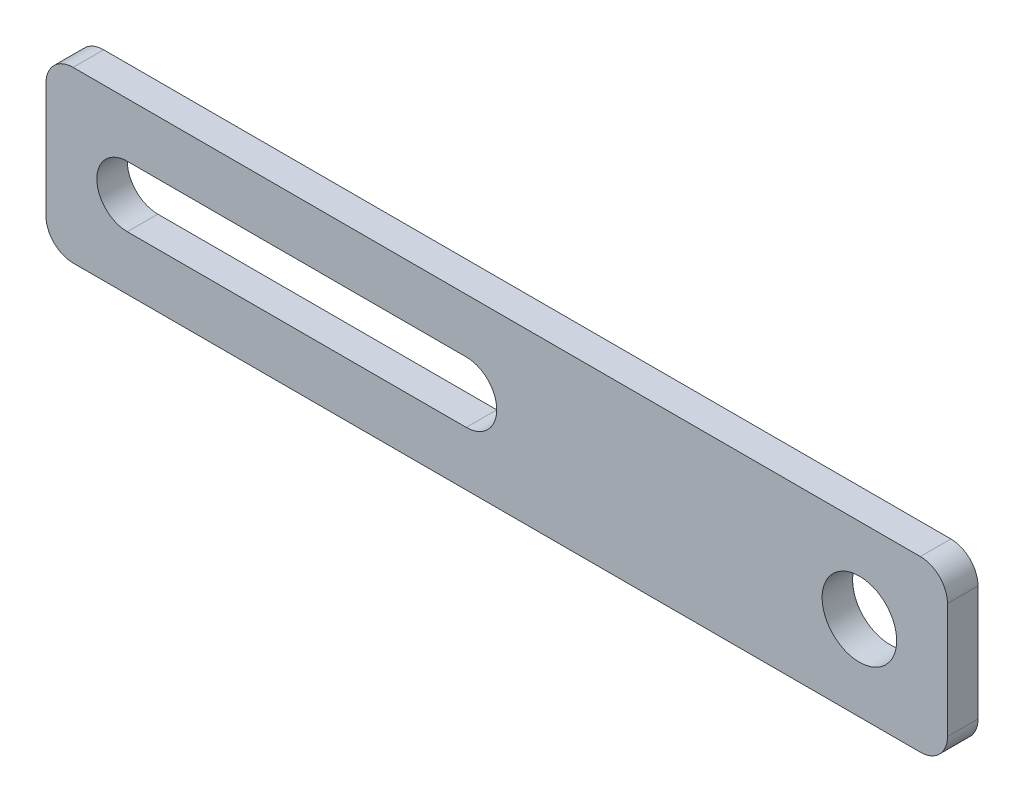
ISO-10303-21;
HEADER;
FILE_DESCRIPTION(('STEP AP214'),'2;1');
FILE_NAME('part.step','',(''),(''),'','','');
FILE_SCHEMA(('AUTOMOTIVE_DESIGN { 1 0 10303 214 1 1 1 1 }'));
ENDSEC;
DATA;
#1=APPLICATION_CONTEXT('core data for automotive mechanical design processes');
#2=APPLICATION_PROTOCOL_DEFINITION('international standard','automotive_design',2000,#1);
#3=PRODUCT_CONTEXT('',#1,'mechanical');
#4=PRODUCT('Part','Part','',(#3));
#5=PRODUCT_RELATED_PRODUCT_CATEGORY('part','',(#4));
#6=PRODUCT_DEFINITION_FORMATION('','',#4);
#7=PRODUCT_DEFINITION_CONTEXT('part definition',#1,'design');
#8=PRODUCT_DEFINITION('design','',#6,#7);
#9=PRODUCT_DEFINITION_SHAPE('','',#8);
#10=(LENGTH_UNIT() NAMED_UNIT(*) SI_UNIT(.MILLI.,.METRE.));
#11=(NAMED_UNIT(*) PLANE_ANGLE_UNIT() SI_UNIT($,.RADIAN.));
#12=(NAMED_UNIT(*) SI_UNIT($,.STERADIAN.) SOLID_ANGLE_UNIT());
#13=UNCERTAINTY_MEASURE_WITH_UNIT(LENGTH_MEASURE(1.E-05),#10,'distance_accuracy_value','');
#14=(GEOMETRIC_REPRESENTATION_CONTEXT(3) GLOBAL_UNCERTAINTY_ASSIGNED_CONTEXT((#13)) GLOBAL_UNIT_ASSIGNED_CONTEXT((#10,
#11,#12)) REPRESENTATION_CONTEXT('',''));
#15=CARTESIAN_POINT('',(0.,0.,0.));
#16=DIRECTION('',(0.,0.,1.));
#17=DIRECTION('',(1.,0.,0.));
#18=AXIS2_PLACEMENT_3D('',#15,#16,#17);
#19=CARTESIAN_POINT('',(71.,12.5,0.));
#20=DIRECTION('',(0.,0.,1.));
#21=DIRECTION('',(0.,1.,0.));
#22=AXIS2_PLACEMENT_3D('',#19,#20,#21);
#23=PLANE('',#22);
#24=DIRECTION('',(-1.,0.,0.));
#25=VECTOR('',#24,1.);
#26=CARTESIAN_POINT('',(71.,12.5,0.));
#27=LINE('',#26,#25);
#28=CARTESIAN_POINT('',(67.,12.5,0.));
#29=VERTEX_POINT('',#28);
#30=CARTESIAN_POINT('',(-58.,12.5,0.));
#31=VERTEX_POINT('',#30);
#32=EDGE_CURVE('E157',#29,#31,#27,.T.);
#33=ORIENTED_EDGE('',*,*,#32,.F.);
#34=CARTESIAN_POINT('',(67.,8.5,0.));
#35=DIRECTION('',(0.,0.,1.));
#36=DIRECTION('',(0.,1.,0.));
#37=AXIS2_PLACEMENT_3D('',#34,#35,#36);
#38=CIRCLE('',#37,4.);
#39=CARTESIAN_POINT('',(71.,8.5,0.));
#40=VERTEX_POINT('',#39);
#41=EDGE_CURVE('E194',#29,#40,#38,.F.);
#42=ORIENTED_EDGE('',*,*,#41,.T.);
#43=DIRECTION('',(0.,-1.,0.));
#44=VECTOR('',#43,1.);
#45=CARTESIAN_POINT('',(71.,12.5,0.));
#46=LINE('',#45,#44);
#47=CARTESIAN_POINT('',(71.,-8.5,0.));
#48=VERTEX_POINT('',#47);
#49=EDGE_CURVE('E169',#40,#48,#46,.T.);
#50=ORIENTED_EDGE('',*,*,#49,.T.);
#51=CARTESIAN_POINT('',(67.,-8.5,0.));
#52=DIRECTION('',(0.,0.,1.));
#53=DIRECTION('',(0.,1.,0.));
#54=AXIS2_PLACEMENT_3D('',#51,#52,#53);
#55=CIRCLE('',#54,4.);
#56=CARTESIAN_POINT('',(67.,-12.5,0.));
#57=VERTEX_POINT('',#56);
#58=EDGE_CURVE('E33',#48,#57,#55,.F.);
#59=ORIENTED_EDGE('',*,*,#58,.T.);
#60=DIRECTION('',(-1.,0.,0.));
#61=VECTOR('',#60,1.);
#62=CARTESIAN_POINT('',(71.,-12.5,0.));
#63=LINE('',#62,#61);
#64=CARTESIAN_POINT('',(-58.,-12.5,0.));
#65=VERTEX_POINT('',#64);
#66=EDGE_CURVE('E152',#57,#65,#63,.T.);
#67=ORIENTED_EDGE('',*,*,#66,.T.);
#68=CARTESIAN_POINT('',(-58.,-8.5,0.));
#69=DIRECTION('',(0.,0.,1.));
#70=DIRECTION('',(0.,1.,0.));
#71=AXIS2_PLACEMENT_3D('',#68,#69,#70);
#72=CIRCLE('',#71,4.);
#73=CARTESIAN_POINT('',(-62.,-8.5,0.));
#74=VERTEX_POINT('',#73);
#75=EDGE_CURVE('E190',#65,#74,#72,.F.);
#76=ORIENTED_EDGE('',*,*,#75,.T.);
#77=DIRECTION('',(0.,-1.,0.));
#78=VECTOR('',#77,1.);
#79=CARTESIAN_POINT('',(-62.,12.5,0.));
#80=LINE('',#79,#78);
#81=CARTESIAN_POINT('',(-62.,8.5,0.));
#82=VERTEX_POINT('',#81);
#83=EDGE_CURVE('E166',#82,#74,#80,.T.);
#84=ORIENTED_EDGE('',*,*,#83,.F.);
#85=CARTESIAN_POINT('',(-58.,8.5,0.));
#86=DIRECTION('',(0.,0.,1.));
#87=DIRECTION('',(0.,1.,0.));
#88=AXIS2_PLACEMENT_3D('',#85,#86,#87);
#89=CIRCLE('',#88,4.);
#90=EDGE_CURVE('E192',#82,#31,#89,.F.);
#91=ORIENTED_EDGE('',*,*,#90,.T.);
#92=EDGE_LOOP('',(#33,#42,#50,#59,#67,#76,#84,#91));
#93=FACE_BOUND('',#92,.T.);
#94=CARTESIAN_POINT('',(58.,0.,0.));
#95=DIRECTION('',(0.,0.,1.));
#96=DIRECTION('',(0.,1.,0.));
#97=AXIS2_PLACEMENT_3D('',#94,#95,#96);
#98=CIRCLE('',#97,5.5);
#99=CARTESIAN_POINT('',(58.,5.5,0.));
#100=VERTEX_POINT('',#99);
#101=EDGE_CURVE('E147',#100,#100,#98,.T.);
#102=ORIENTED_EDGE('',*,*,#101,.T.);
#103=EDGE_LOOP('',(#102));
#104=FACE_BOUND('',#103,.T.);
#105=CARTESIAN_POINT('',(-50.,0.,0.));
#106=DIRECTION('',(0.,0.,-1.));
#107=DIRECTION('',(0.,-1.,0.));
#108=AXIS2_PLACEMENT_3D('',#105,#106,#107);
#109=CIRCLE('',#108,4.5);
#110=CARTESIAN_POINT('',(-50.,-4.5,0.));
#111=VERTEX_POINT('',#110);
#112=CARTESIAN_POINT('',(-50.,4.5,0.));
#113=VERTEX_POINT('',#112);
#114=EDGE_CURVE('E108',#111,#113,#109,.T.);
#115=ORIENTED_EDGE('',*,*,#114,.F.);
#116=DIRECTION('',(1.,0.,0.));
#117=VECTOR('',#116,1.);
#118=CARTESIAN_POINT('',(-50.,-4.5,0.));
#119=LINE('',#118,#117);
#120=CARTESIAN_POINT('',(0.,-4.5,0.));
#121=VERTEX_POINT('',#120);
#122=EDGE_CURVE('E137',#111,#121,#119,.T.);
#123=ORIENTED_EDGE('',*,*,#122,.T.);
#124=CARTESIAN_POINT('',(0.,0.,0.));
#125=DIRECTION('',(0.,0.,1.));
#126=DIRECTION('',(0.,1.,0.));
#127=AXIS2_PLACEMENT_3D('',#124,#125,#126);
#128=CIRCLE('',#127,4.5);
#129=CARTESIAN_POINT('',(0.,4.5,0.));
#130=VERTEX_POINT('',#129);
#131=EDGE_CURVE('E134',#121,#130,#128,.T.);
#132=ORIENTED_EDGE('',*,*,#131,.T.);
#133=DIRECTION('',(1.,0.,0.));
#134=VECTOR('',#133,1.);
#135=CARTESIAN_POINT('',(-50.,4.5,0.));
#136=LINE('',#135,#134);
#137=EDGE_CURVE('E132',#113,#130,#136,.T.);
#138=ORIENTED_EDGE('',*,*,#137,.F.);
#139=EDGE_LOOP('',(#115,#123,#132,#138));
#140=FACE_BOUND('',#139,.T.);
#141=ADVANCED_FACE('F14',(#93,#104,#140),#23,.F.);
#142=CARTESIAN_POINT('',(71.,12.5,4.5));
#143=DIRECTION('',(0.,0.,1.));
#144=DIRECTION('',(0.,1.,0.));
#145=AXIS2_PLACEMENT_3D('',#142,#143,#144);
#146=PLANE('',#145);
#147=DIRECTION('',(0.,-1.,0.));
#148=VECTOR('',#147,1.);
#149=CARTESIAN_POINT('',(71.,12.5,4.5));
#150=LINE('',#149,#148);
#151=CARTESIAN_POINT('',(71.,8.5,4.5));
#152=VERTEX_POINT('',#151);
#153=CARTESIAN_POINT('',(71.,-8.5,4.5));
#154=VERTEX_POINT('',#153);
#155=EDGE_CURVE('E160',#152,#154,#150,.T.);
#156=ORIENTED_EDGE('',*,*,#155,.F.);
#157=CARTESIAN_POINT('',(67.,8.5,4.5));
#158=DIRECTION('',(0.,0.,1.));
#159=DIRECTION('',(0.,1.,0.));
#160=AXIS2_PLACEMENT_3D('',#157,#158,#159);
#161=CIRCLE('',#160,4.);
#162=CARTESIAN_POINT('',(67.,12.5,4.5));
#163=VERTEX_POINT('',#162);
#164=EDGE_CURVE('E182',#152,#163,#161,.T.);
#165=ORIENTED_EDGE('',*,*,#164,.T.);
#166=DIRECTION('',(-1.,0.,0.));
#167=VECTOR('',#166,1.);
#168=CARTESIAN_POINT('',(71.,12.5,4.5));
#169=LINE('',#168,#167);
#170=CARTESIAN_POINT('',(-58.,12.5,4.5));
#171=VERTEX_POINT('',#170);
#172=EDGE_CURVE('E154',#163,#171,#169,.T.);
#173=ORIENTED_EDGE('',*,*,#172,.T.);
#174=CARTESIAN_POINT('',(-58.,8.5,4.5));
#175=DIRECTION('',(0.,0.,1.));
#176=DIRECTION('',(0.,1.,0.));
#177=AXIS2_PLACEMENT_3D('',#174,#175,#176);
#178=CIRCLE('',#177,4.);
#179=CARTESIAN_POINT('',(-62.,8.5,4.5));
#180=VERTEX_POINT('',#179);
#181=EDGE_CURVE('E180',#171,#180,#178,.T.);
#182=ORIENTED_EDGE('',*,*,#181,.T.);
#183=DIRECTION('',(0.,-1.,0.));
#184=VECTOR('',#183,1.);
#185=CARTESIAN_POINT('',(-62.,12.5,4.5));
#186=LINE('',#185,#184);
#187=CARTESIAN_POINT('',(-62.,-8.5,4.5));
#188=VERTEX_POINT('',#187);
#189=EDGE_CURVE('E163',#180,#188,#186,.T.);
#190=ORIENTED_EDGE('',*,*,#189,.T.);
#191=CARTESIAN_POINT('',(-58.,-8.5,4.5));
#192=DIRECTION('',(0.,0.,1.));
#193=DIRECTION('',(0.,1.,0.));
#194=AXIS2_PLACEMENT_3D('',#191,#192,#193);
#195=CIRCLE('',#194,4.);
#196=CARTESIAN_POINT('',(-58.,-12.5,4.5));
#197=VERTEX_POINT('',#196);
#198=EDGE_CURVE('E178',#188,#197,#195,.T.);
#199=ORIENTED_EDGE('',*,*,#198,.T.);
#200=DIRECTION('',(-1.,0.,0.));
#201=VECTOR('',#200,1.);
#202=CARTESIAN_POINT('',(71.,-12.5,4.5));
#203=LINE('',#202,#201);
#204=CARTESIAN_POINT('',(67.,-12.5,4.5));
#205=VERTEX_POINT('',#204);
#206=EDGE_CURVE('E150',#205,#197,#203,.T.);
#207=ORIENTED_EDGE('',*,*,#206,.F.);
#208=CARTESIAN_POINT('',(67.,-8.5,4.5));
#209=DIRECTION('',(0.,0.,1.));
#210=DIRECTION('',(0.,1.,0.));
#211=AXIS2_PLACEMENT_3D('',#208,#209,#210);
#212=CIRCLE('',#211,4.);
#213=EDGE_CURVE('E176',#205,#154,#212,.T.);
#214=ORIENTED_EDGE('',*,*,#213,.T.);
#215=EDGE_LOOP('',(#156,#165,#173,#182,#190,#199,#207,#214));
#216=FACE_BOUND('',#215,.T.);
#217=CARTESIAN_POINT('',(58.,0.,4.5));
#218=DIRECTION('',(0.,0.,1.));
#219=DIRECTION('',(0.,1.,0.));
#220=AXIS2_PLACEMENT_3D('',#217,#218,#219);
#221=CIRCLE('',#220,5.5);
#222=CARTESIAN_POINT('',(58.,5.5,4.5));
#223=VERTEX_POINT('',#222);
#224=EDGE_CURVE('E112',#223,#223,#221,.T.);
#225=ORIENTED_EDGE('',*,*,#224,.F.);
#226=EDGE_LOOP('',(#225));
#227=FACE_BOUND('',#226,.T.);
#228=DIRECTION('',(1.,0.,0.));
#229=VECTOR('',#228,1.);
#230=CARTESIAN_POINT('',(-50.,-4.5,4.5));
#231=LINE('',#230,#229);
#232=CARTESIAN_POINT('',(-50.,-4.5,4.5));
#233=VERTEX_POINT('',#232);
#234=CARTESIAN_POINT('',(0.,-4.5,4.5));
#235=VERTEX_POINT('',#234);
#236=EDGE_CURVE('E126',#233,#235,#231,.T.);
#237=ORIENTED_EDGE('',*,*,#236,.F.);
#238=CARTESIAN_POINT('',(-50.,0.,4.5));
#239=DIRECTION('',(0.,0.,-1.));
#240=DIRECTION('',(0.,-1.,0.));
#241=AXIS2_PLACEMENT_3D('',#238,#239,#240);
#242=CIRCLE('',#241,4.5);
#243=CARTESIAN_POINT('',(-50.,4.5,4.5));
#244=VERTEX_POINT('',#243);
#245=EDGE_CURVE('E105',#233,#244,#242,.T.);
#246=ORIENTED_EDGE('',*,*,#245,.T.);
#247=DIRECTION('',(1.,0.,0.));
#248=VECTOR('',#247,1.);
#249=CARTESIAN_POINT('',(-50.,4.5,4.5));
#250=LINE('',#249,#248);
#251=CARTESIAN_POINT('',(0.,4.5,4.5));
#252=VERTEX_POINT('',#251);
#253=EDGE_CURVE('E116',#244,#252,#250,.T.);
#254=ORIENTED_EDGE('',*,*,#253,.T.);
#255=CARTESIAN_POINT('',(0.,0.,4.5));
#256=DIRECTION('',(0.,0.,1.));
#257=DIRECTION('',(0.,1.,0.));
#258=AXIS2_PLACEMENT_3D('',#255,#256,#257);
#259=CIRCLE('',#258,4.5);
#260=EDGE_CURVE('E121',#235,#252,#259,.T.);
#261=ORIENTED_EDGE('',*,*,#260,.F.);
#262=EDGE_LOOP('',(#237,#246,#254,#261));
#263=FACE_BOUND('',#262,.T.);
#264=ADVANCED_FACE('F124',(#216,#227,#263),#146,.T.);
#265=CARTESIAN_POINT('',(71.,12.5,0.));
#266=DIRECTION('',(1.,0.,0.));
#267=DIRECTION('',(0.,1.,0.));
#268=AXIS2_PLACEMENT_3D('',#265,#266,#267);
#269=PLANE('',#268);
#270=ORIENTED_EDGE('',*,*,#49,.F.);
#271=DIRECTION('',(0.,0.,1.));
#272=VECTOR('',#271,1.);
#273=CARTESIAN_POINT('',(71.,8.5,0.));
#274=LINE('',#273,#272);
#275=EDGE_CURVE('E173',#40,#152,#274,.T.);
#276=ORIENTED_EDGE('',*,*,#275,.T.);
#277=ORIENTED_EDGE('',*,*,#155,.T.);
#278=DIRECTION('',(0.,0.,1.));
#279=VECTOR('',#278,1.);
#280=CARTESIAN_POINT('',(71.,-8.5,0.));
#281=LINE('',#280,#279);
#282=EDGE_CURVE('E171',#154,#48,#281,.F.);
#283=ORIENTED_EDGE('',*,*,#282,.T.);
#284=EDGE_LOOP('',(#270,#276,#277,#283));
#285=FACE_BOUND('',#284,.T.);
#286=ADVANCED_FACE('F233',(#285),#269,.T.);
#287=CARTESIAN_POINT('',(-62.,12.5,0.));
#288=DIRECTION('',(1.,0.,0.));
#289=DIRECTION('',(0.,1.,0.));
#290=AXIS2_PLACEMENT_3D('',#287,#288,#289);
#291=PLANE('',#290);
#292=ORIENTED_EDGE('',*,*,#189,.F.);
#293=DIRECTION('',(0.,0.,1.));
#294=VECTOR('',#293,1.);
#295=CARTESIAN_POINT('',(-62.,8.5,0.));
#296=LINE('',#295,#294);
#297=EDGE_CURVE('E199',#180,#82,#296,.F.);
#298=ORIENTED_EDGE('',*,*,#297,.T.);
#299=ORIENTED_EDGE('',*,*,#83,.T.);
#300=DIRECTION('',(0.,0.,1.));
#301=VECTOR('',#300,1.);
#302=CARTESIAN_POINT('',(-62.,-8.5,0.));
#303=LINE('',#302,#301);
#304=EDGE_CURVE('E196',#74,#188,#303,.T.);
#305=ORIENTED_EDGE('',*,*,#304,.T.);
#306=EDGE_LOOP('',(#292,#298,#299,#305));
#307=FACE_BOUND('',#306,.T.);
#308=ADVANCED_FACE('F214',(#307),#291,.F.);
#309=CARTESIAN_POINT('',(71.,12.5,4.5));
#310=DIRECTION('',(0.,-1.,0.));
#311=DIRECTION('',(1.,0.,0.));
#312=AXIS2_PLACEMENT_3D('',#309,#310,#311);
#313=PLANE('',#312);
#314=ORIENTED_EDGE('',*,*,#172,.F.);
#315=DIRECTION('',(0.,0.,1.));
#316=VECTOR('',#315,1.);
#317=CARTESIAN_POINT('',(67.,12.5,0.));
#318=LINE('',#317,#316);
#319=EDGE_CURVE('E187',#163,#29,#318,.F.);
#320=ORIENTED_EDGE('',*,*,#319,.T.);
#321=ORIENTED_EDGE('',*,*,#32,.T.);
#322=DIRECTION('',(0.,0.,1.));
#323=VECTOR('',#322,1.);
#324=CARTESIAN_POINT('',(-58.,12.5,4.5));
#325=LINE('',#324,#323);
#326=EDGE_CURVE('E184',#31,#171,#325,.T.);
#327=ORIENTED_EDGE('',*,*,#326,.T.);
#328=EDGE_LOOP('',(#314,#320,#321,#327));
#329=FACE_BOUND('',#328,.T.);
#330=ADVANCED_FACE('F225',(#329),#313,.F.);
#331=CARTESIAN_POINT('',(71.,-12.5,4.5));
#332=DIRECTION('',(0.,-1.,0.));
#333=DIRECTION('',(1.,0.,0.));
#334=AXIS2_PLACEMENT_3D('',#331,#332,#333);
#335=PLANE('',#334);
#336=ORIENTED_EDGE('',*,*,#206,.T.);
#337=DIRECTION('',(0.,0.,1.));
#338=VECTOR('',#337,1.);
#339=CARTESIAN_POINT('',(-58.,-12.5,0.));
#340=LINE('',#339,#338);
#341=EDGE_CURVE('E9',#197,#65,#340,.F.);
#342=ORIENTED_EDGE('',*,*,#341,.T.);
#343=ORIENTED_EDGE('',*,*,#66,.F.);
#344=DIRECTION('',(0.,0.,1.));
#345=VECTOR('',#344,1.);
#346=CARTESIAN_POINT('',(67.,-12.5,4.5));
#347=LINE('',#346,#345);
#348=EDGE_CURVE('E21',#57,#205,#347,.T.);
#349=ORIENTED_EDGE('',*,*,#348,.T.);
#350=EDGE_LOOP('',(#336,#342,#343,#349));
#351=FACE_BOUND('',#350,.T.);
#352=ADVANCED_FACE('F203',(#351),#335,.T.);
#353=CARTESIAN_POINT('',(58.,0.,0.));
#354=DIRECTION('',(0.,0.,1.));
#355=DIRECTION('',(0.,1.,0.));
#356=AXIS2_PLACEMENT_3D('',#353,#354,#355);
#357=CYLINDRICAL_SURFACE('',#356,5.5);
#358=ORIENTED_EDGE('',*,*,#101,.F.);
#359=EDGE_LOOP('',(#358));
#360=FACE_BOUND('',#359,.T.);
#361=ORIENTED_EDGE('',*,*,#224,.T.);
#362=EDGE_LOOP('',(#361));
#363=FACE_BOUND('',#362,.T.);
#364=ADVANCED_FACE('F265',(#360,#363),#357,.F.);
#365=CARTESIAN_POINT('',(-50.,0.,0.));
#366=DIRECTION('',(0.,0.,1.));
#367=DIRECTION('',(0.,1.,0.));
#368=AXIS2_PLACEMENT_3D('',#365,#366,#367);
#369=CYLINDRICAL_SURFACE('',#368,4.5);
#370=DIRECTION('',(0.,0.,1.));
#371=VECTOR('',#370,1.);
#372=CARTESIAN_POINT('',(-50.,4.5,0.));
#373=LINE('',#372,#371);
#374=EDGE_CURVE('E101',#113,#244,#373,.T.);
#375=ORIENTED_EDGE('',*,*,#374,.T.);
#376=ORIENTED_EDGE('',*,*,#245,.F.);
#377=DIRECTION('',(0.,0.,1.));
#378=VECTOR('',#377,1.);
#379=CARTESIAN_POINT('',(-50.,-4.5,0.));
#380=LINE('',#379,#378);
#381=EDGE_CURVE('E140',#111,#233,#380,.T.);
#382=ORIENTED_EDGE('',*,*,#381,.F.);
#383=ORIENTED_EDGE('',*,*,#114,.T.);
#384=EDGE_LOOP('',(#375,#376,#382,#383));
#385=FACE_BOUND('',#384,.T.);
#386=ADVANCED_FACE('F103',(#385),#369,.F.);
#387=CARTESIAN_POINT('',(-50.,4.5,0.));
#388=DIRECTION('',(0.,-1.,0.));
#389=DIRECTION('',(1.,0.,0.));
#390=AXIS2_PLACEMENT_3D('',#387,#388,#389);
#391=PLANE('',#390);
#392=DIRECTION('',(0.,0.,1.));
#393=VECTOR('',#392,1.);
#394=CARTESIAN_POINT('',(0.,4.5,0.));
#395=LINE('',#394,#393);
#396=EDGE_CURVE('E113',#130,#252,#395,.T.);
#397=ORIENTED_EDGE('',*,*,#396,.T.);
#398=ORIENTED_EDGE('',*,*,#253,.F.);
#399=ORIENTED_EDGE('',*,*,#374,.F.);
#400=ORIENTED_EDGE('',*,*,#137,.T.);
#401=EDGE_LOOP('',(#397,#398,#399,#400));
#402=FACE_BOUND('',#401,.T.);
#403=ADVANCED_FACE('F117',(#402),#391,.T.);
#404=CARTESIAN_POINT('',(0.,0.,0.));
#405=DIRECTION('',(0.,0.,1.));
#406=DIRECTION('',(0.,1.,0.));
#407=AXIS2_PLACEMENT_3D('',#404,#405,#406);
#408=CYLINDRICAL_SURFACE('',#407,4.5);
#409=DIRECTION('',(0.,0.,1.));
#410=VECTOR('',#409,1.);
#411=CARTESIAN_POINT('',(0.,-4.5,0.));
#412=LINE('',#411,#410);
#413=EDGE_CURVE('E142',#121,#235,#412,.T.);
#414=ORIENTED_EDGE('',*,*,#413,.T.);
#415=ORIENTED_EDGE('',*,*,#260,.T.);
#416=ORIENTED_EDGE('',*,*,#396,.F.);
#417=ORIENTED_EDGE('',*,*,#131,.F.);
#418=EDGE_LOOP('',(#414,#415,#416,#417));
#419=FACE_BOUND('',#418,.T.);
#420=ADVANCED_FACE('F273',(#419),#408,.F.);
#421=CARTESIAN_POINT('',(-50.,-4.5,0.));
#422=DIRECTION('',(0.,-1.,0.));
#423=DIRECTION('',(1.,0.,0.));
#424=AXIS2_PLACEMENT_3D('',#421,#422,#423);
#425=PLANE('',#424);
#426=ORIENTED_EDGE('',*,*,#122,.F.);
#427=ORIENTED_EDGE('',*,*,#381,.T.);
#428=ORIENTED_EDGE('',*,*,#236,.T.);
#429=ORIENTED_EDGE('',*,*,#413,.F.);
#430=EDGE_LOOP('',(#426,#427,#428,#429));
#431=FACE_BOUND('',#430,.T.);
#432=ADVANCED_FACE('F276',(#431),#425,.F.);
#433=CARTESIAN_POINT('',(67.,8.5,0.));
#434=DIRECTION('',(0.,0.,-1.));
#435=DIRECTION('',(0.,-1.,0.));
#436=AXIS2_PLACEMENT_3D('',#433,#434,#435);
#437=CYLINDRICAL_SURFACE('',#436,4.);
#438=ORIENTED_EDGE('',*,*,#41,.F.);
#439=ORIENTED_EDGE('',*,*,#319,.F.);
#440=ORIENTED_EDGE('',*,*,#164,.F.);
#441=ORIENTED_EDGE('',*,*,#275,.F.);
#442=EDGE_LOOP('',(#438,#439,#440,#441));
#443=FACE_BOUND('',#442,.T.);
#444=ADVANCED_FACE('F230',(#443),#437,.T.);
#445=CARTESIAN_POINT('',(-58.,8.5,4.5));
#446=DIRECTION('',(0.,0.,1.));
#447=DIRECTION('',(0.,1.,0.));
#448=AXIS2_PLACEMENT_3D('',#445,#446,#447);
#449=CYLINDRICAL_SURFACE('',#448,4.);
#450=ORIENTED_EDGE('',*,*,#90,.F.);
#451=ORIENTED_EDGE('',*,*,#297,.F.);
#452=ORIENTED_EDGE('',*,*,#181,.F.);
#453=ORIENTED_EDGE('',*,*,#326,.F.);
#454=EDGE_LOOP('',(#450,#451,#452,#453));
#455=FACE_BOUND('',#454,.T.);
#456=ADVANCED_FACE('F222',(#455),#449,.T.);
#457=CARTESIAN_POINT('',(-58.,-8.5,0.));
#458=DIRECTION('',(0.,0.,-1.));
#459=DIRECTION('',(0.,-1.,0.));
#460=AXIS2_PLACEMENT_3D('',#457,#458,#459);
#461=CYLINDRICAL_SURFACE('',#460,4.);
#462=ORIENTED_EDGE('',*,*,#75,.F.);
#463=ORIENTED_EDGE('',*,*,#341,.F.);
#464=ORIENTED_EDGE('',*,*,#198,.F.);
#465=ORIENTED_EDGE('',*,*,#304,.F.);
#466=EDGE_LOOP('',(#462,#463,#464,#465));
#467=FACE_BOUND('',#466,.T.);
#468=ADVANCED_FACE('F212',(#467),#461,.T.);
#469=CARTESIAN_POINT('',(67.,-8.5,4.5));
#470=DIRECTION('',(0.,0.,1.));
#471=DIRECTION('',(0.,1.,0.));
#472=AXIS2_PLACEMENT_3D('',#469,#470,#471);
#473=CYLINDRICAL_SURFACE('',#472,4.);
#474=ORIENTED_EDGE('',*,*,#58,.F.);
#475=ORIENTED_EDGE('',*,*,#282,.F.);
#476=ORIENTED_EDGE('',*,*,#213,.F.);
#477=ORIENTED_EDGE('',*,*,#348,.F.);
#478=EDGE_LOOP('',(#474,#475,#476,#477));
#479=FACE_BOUND('',#478,.T.);
#480=ADVANCED_FACE('F235',(#479),#473,.T.);
#481=CLOSED_SHELL('',(#141,#264,#286,#308,#330,#352,#364,#386,#403,#420,#432,#444,#456,#468,#480));
#482=MANIFOLD_SOLID_BREP('B1',#481);
#483=ADVANCED_BREP_SHAPE_REPRESENTATION('',(#18,#482),#14);
#484=SHAPE_DEFINITION_REPRESENTATION(#9,#483);
ENDSEC;
END-ISO-10303-21;
